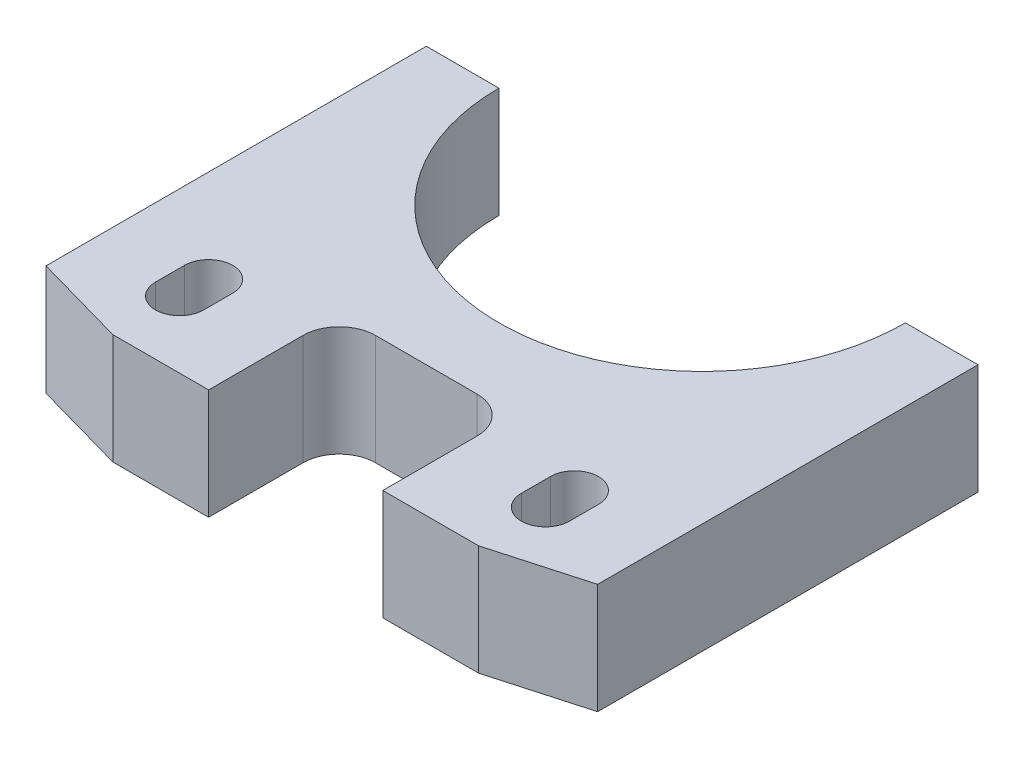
from build123d import *

# Parameters (mm, degrees)
EXTRUDE1_DEPTH     = 9.652
SKETCH2_R          = 1.3589
CUT_EXTRUDE1_DEPTH = 10.922


with BuildPart() as part:
    # Sketch1 → Extrude1 (new body)
    with BuildSketch(Plane(origin=(0, 0, 0), x_dir=(1, 0, 0), z_dir=(0, 1, 0))):
        with BuildLine():
            Line((-16.002, -58.42), (-24.13, -56.134))
            Line((-24.13, -56.134), (-24.13, -22.86))
            Line((-24.13, -22.86), (-17.78, -22.86))
            ThreePointArc((-17.78, -22.86), (0, -40.64), (17.78, -22.86))
            Line((17.78, -22.86), (24.13, -22.86))
            Line((24.13, -22.86), (24.13, -56.134))
            Line((24.13, -56.134), (16.002, -58.42))
            Line((16.002, -58.42), (7.62, -58.42))
            Line((7.62, -58.42), (7.62, -50.165))
            ThreePointArc((7.62, -50.165), (6.69006403, -47.91993597), (4.445, -46.99))
            Line((4.445, -46.99), (-4.445, -46.99))
            ThreePointArc((-4.445, -46.99), (-6.69006403, -47.91993597), (-7.62, -50.165))
            Line((-7.62, -50.165), (-7.62, -58.42))
            Line((-7.62, -58.42), (-16.002, -58.42))
        make_face()
        with BuildLine():
            Line((18.1102, -52.578), (18.1102, -50.038))
            ThreePointArc((18.1102, -50.038), (16.002, -47.9298), (13.8938, -50.038))
            Line((13.8938, -50.038), (13.8938, -52.578))
            ThreePointArc((13.8938, -52.578), (16.002, -54.6862), (18.1102, -52.578))
        make_face(mode=Mode.SUBTRACT)
        with BuildLine():
            Line((-13.8938, -52.578), (-13.8938, -50.038))
            ThreePointArc((-13.8938, -50.038), (-16.002, -47.9298), (-18.1102, -50.038))
            Line((-18.1102, -50.038), (-18.1102, -52.578))
            ThreePointArc((-18.1102, -52.578), (-16.002, -54.6862), (-13.8938, -52.578))
        make_face(mode=Mode.SUBTRACT)
    extrude(amount=EXTRUDE1_DEPTH)

    # Sketch2 → Cut-Extrude1 (cut)
    with BuildSketch(Plane(origin=(0, 0, 22.86), x_dir=(-1, 0, 0), z_dir=(0, 0, -1))):
        with Locations((-20.828, 4.826)):
            Circle(SKETCH2_R)
        with Locations((20.828, 4.826)):
            Circle(SKETCH2_R)
    extrude(amount=-CUT_EXTRUDE1_DEPTH, mode=Mode.SUBTRACT)


solid = part.part
